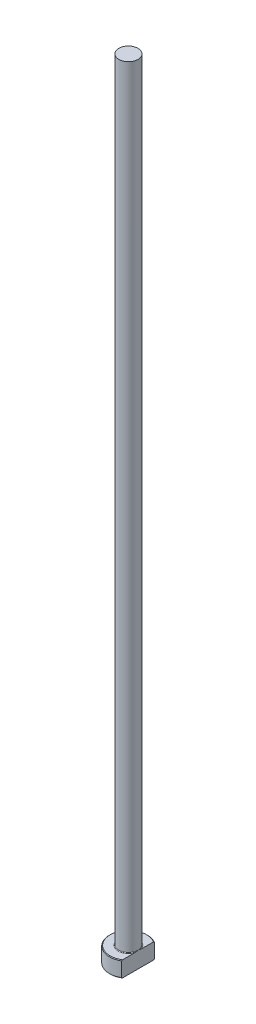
from build123d import *
from build123d.topology import SkipClean

# Parameters (mm, degrees)
CHAMFER1_SIZE = 0.2
FILLET1_R     = 0.2
KEY_DEPTH     = 251.143958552


with BuildPart() as part:
    # Sketch1 → Revolve1 (revolve)
    with BuildSketch(Plane.XY, mode=Mode.PRIVATE) as revolve1_sk:
        Polygon((0, 0), (-6, 0), (-6, 5), (-3.05, 5), (-3.05, 250), (0, 250), align=None)
    revolve(revolve1_sk.sketch.rotate(Axis((0, 259.958771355, 0), (0, -1, 0)), 270), axis=Axis((0, 259.958771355, 0), (0, -1, 0)))

    # Chamfer1
    chamfer1_edges = [part.edges().sort_by_distance(p)[0] for p in [
        (0, 5, -6),
        (0, 0, -6),
    ]]
    chamfer(chamfer1_edges, length=CHAMFER1_SIZE)

    # Fillet1
    fillet1_edges = [part.edges().sort_by_distance(p)[0] for p in [
        (0, 5, -3.05),
    ]]
    fillet(fillet1_edges, radius=FILLET1_R)

    # Sketch2 → KEY (cut, through all)
    with SkipClean():  # the faces are left unmerged after this step: merging them gives an invalid solid
        with BuildSketch(Plane(origin=(0, 0, 0), x_dir=(1, 0, 0), z_dir=(0, 1, 0))):
            with BuildLine():
                Line((3.05, 5.166962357), (3.05, -5.166962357))
                ThreePointArc((3.05, -5.166962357), (6, 0), (3.05, 5.166962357))
            make_face()
        extrude(amount=KEY_DEPTH, mode=Mode.SUBTRACT)


solid = part.part
